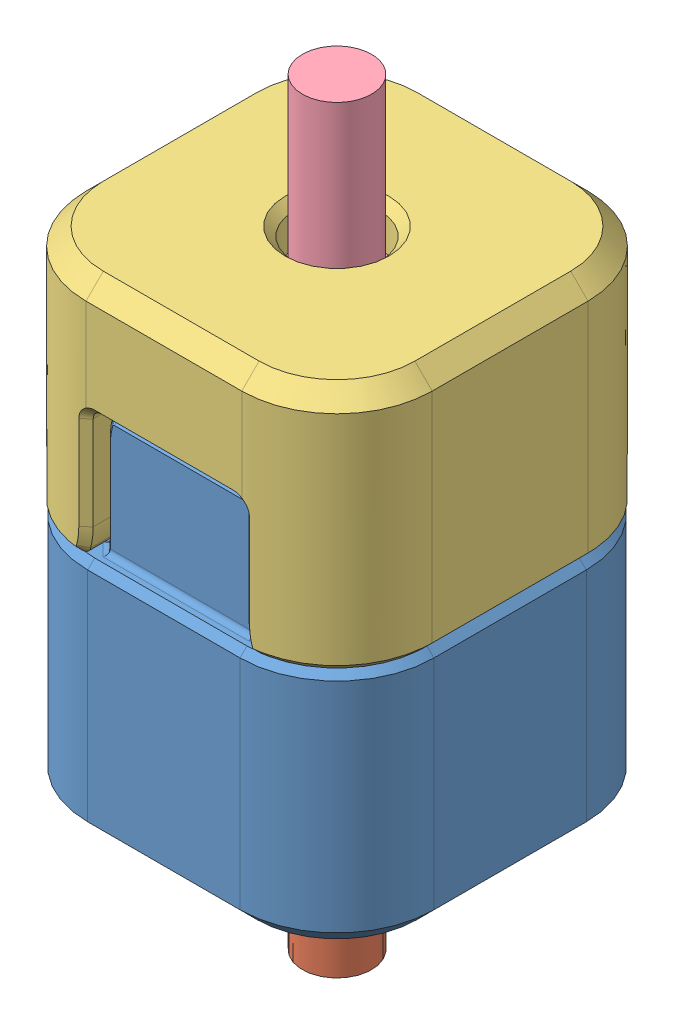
SolidWorks assembly TLM20X20.SLDASM, configuration Default (file format 13000). Lengths in mm.
Overall size (20 43.8 20).
6 component instances, 4 part files, 9 mates.
Components (placement in the parent):
- TLM20X20 MALE HALF-1: TLM20X20 MALE HALF.SLDASM [Default] at origin size (20 29.2 20)
  - TLM20X20-M-1: TLM20X20-M.SLDPRT [Default] at origin size (20 21 20)
  - SHCSM4-.7L25-1: SHCSM4-.7L25.sldprt [SHCSM4-.7L25] at (0 2.8 0) x (-0.186689 0 -0.982419) z (0 -1 0) size (7 7 29)
- TLM20X20 FEMALE HALF-1: TLM20X20 FEMALE HALF.SLDASM [Default] at origin size (20 21.6 20)
  - TLM20X20-F-1: TLM20X20-F.SLDPRT [Default] at origin size (20 14 20)
  - SHCSM4-.7L10-1: SHCSM4-.7L10.sldprt [SHCSM4-.7L10] at (0 11.6 0) x (0.9614 0 -0.275155) z (0 1 0) size (7 7 14)
Mates (geometry in assembly coordinates):
- Coincident5: coincident aligned: plane of Assem10^TLM20X20-1/TLM20X20-F-1 through (0 0 0) normal (1 0 0)
- Coincident6: coincident aligned: plane of Assem10^TLM20X20-1/TLM20X20-F-1 through (0 0 0) normal (0 0 1)
- Coincident7: coincident anti-aligned: plane of Assem9^TLM20X20-1/TLM20X20-M-1 through (4.4 0 -4.4) normal (0 1 0); plane of Assem10^TLM20X20-1/TLM20X20-F-1 through (-4.4 0 -4.4) normal (0 -1 0)
- Coincident8: coincident aligned: plane of TLM20X20 MALE HALF-1 through (0 0 0) normal (0 0 1)
- Coincident9: coincident aligned: plane of TLM20X20 MALE HALF-1 through (0 0 0) normal (0 1 0)
- Coincident10: coincident aligned: plane of TLM20X20 MALE HALF-1 through (0 0 0) normal (1 0 0)
- Coincident11: coincident aligned: plane of TLM20X20 FEMALE HALF-1 through (0 0 0) normal (0 0 1)
- Coincident12: coincident aligned: plane of TLM20X20 FEMALE HALF-1 through (0 0 0) normal (0 1 0)
- Coincident13: coincident aligned: plane of TLM20X20 FEMALE HALF-1 through (0 0 0) normal (1 0 0)
